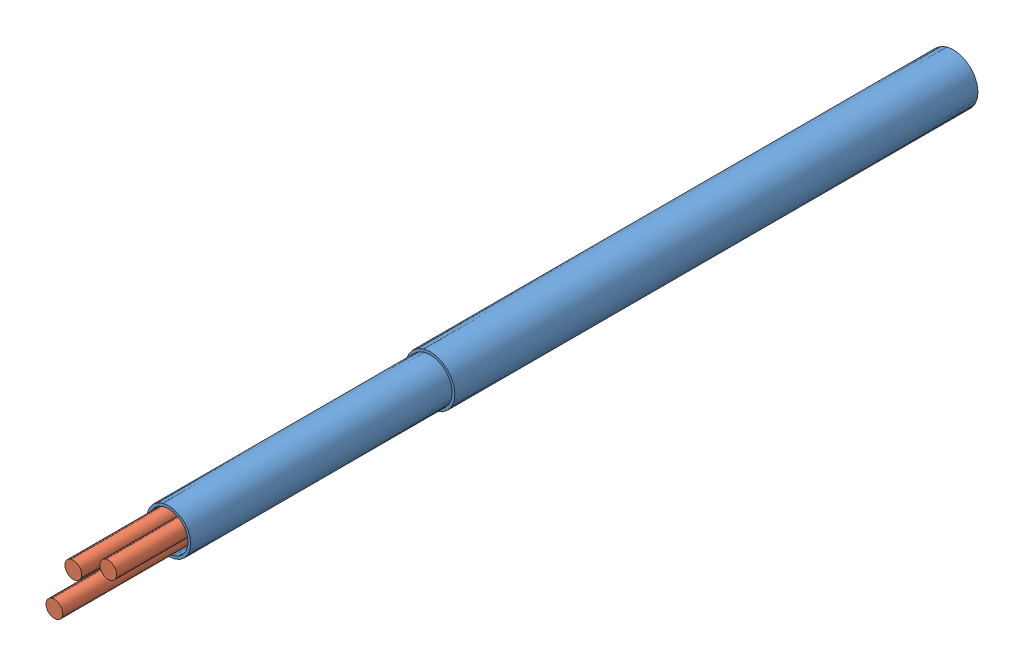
SolidWorks assembly SWA_cable diag 3x 14ga w_peek.SLDASM, configuration Default (file format 5000). Lengths in mm.
Overall size (4.78 4.78 87.29).
4 component instances, 2 part files, 0 mates.
Components (placement in the parent):
- SWPS_cable 3cond w_peek-1: SWPS_cable 3cond w_peek.SLDPRT [Default] at (3.1932 0.674 -38.1) size (4.78 4.78 76.2)
- SWPS_14 AWG wire-5: SWPS_14 AWG wire.SLDPRT [Default] at (2.3162 1.1678 8.3864) size (1.63 1.63 38.1)
- SWPS_14 AWG wire-4: SWPS_14 AWG wire.SLDPRT [Default] at (3.1808 -0.327 11.0871) size (1.63 1.63 38.1)
- SWPS_14 AWG wire-3: SWPS_14 AWG wire.SLDPRT [Default] at (4.0427 1.2049 6.7205) size (1.63 1.63 38.1)
